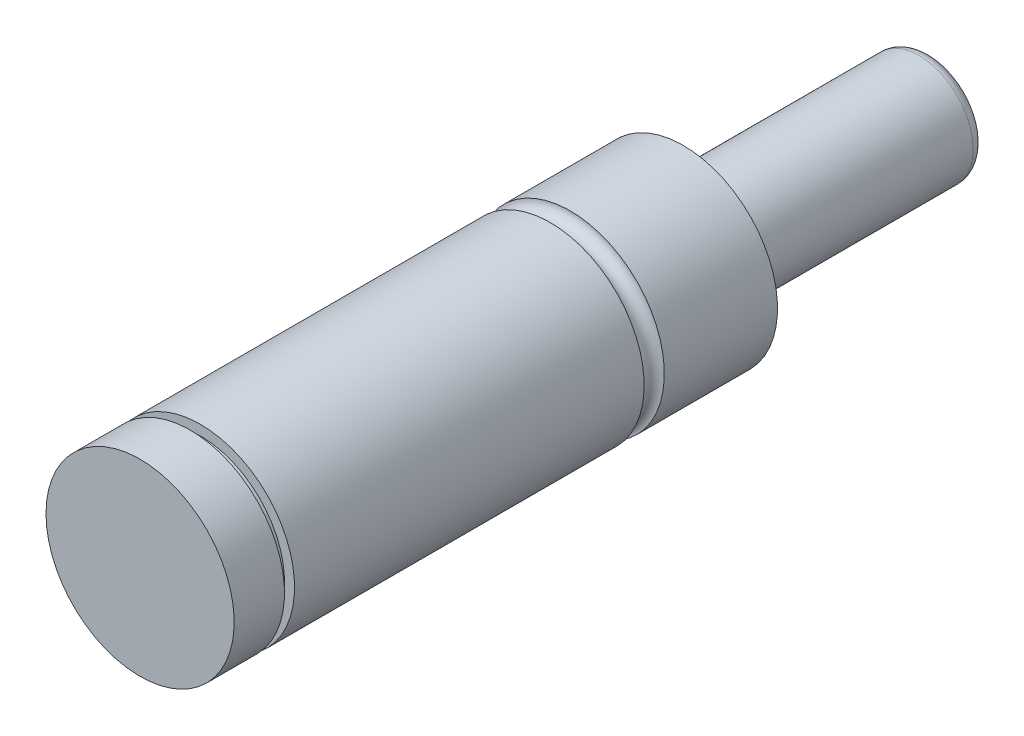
from build123d import *


with BuildPart() as part:
    # Logo3_bib1 → Revolve1 (revolve)
    with BuildSketch(Plane(origin=(0, 0, 0), x_dir=(-1, 0, 0), z_dir=(0, -1, 0))):
        with BuildLine():
            Line((0, 79.8576), (0, 0))
            Line((0, 0), (9.4996, 0))
            Line((9.4996, 0), (9.4996, 5.08))
            Line((9.4996, 5.08), (8.4836, 5.08))
            Line((8.4836, 5.08), (8.4836, 6.096))
            Line((8.4836, 6.096), (9.4996, 6.096))
            Line((9.4996, 6.096), (9.4996, 41.402))
            ThreePointArc((9.4996, 41.402), (8.4836, 42.418), (9.4996, 43.434))
            Line((9.4996, 43.434), (9.4996, 54.864))
            Line((9.4996, 54.864), (5.461, 54.864))
            Line((5.461, 54.864), (5.461, 78.6638))
            ThreePointArc((5.461, 78.6638), (5.111344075, 79.507944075), (4.2672, 79.8576))
            Line((4.2672, 79.8576), (0, 79.8576))
        make_face()
    revolve(axis=Axis((0, 0, -88.073796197), (0, 0, 1)))


solid = part.part
